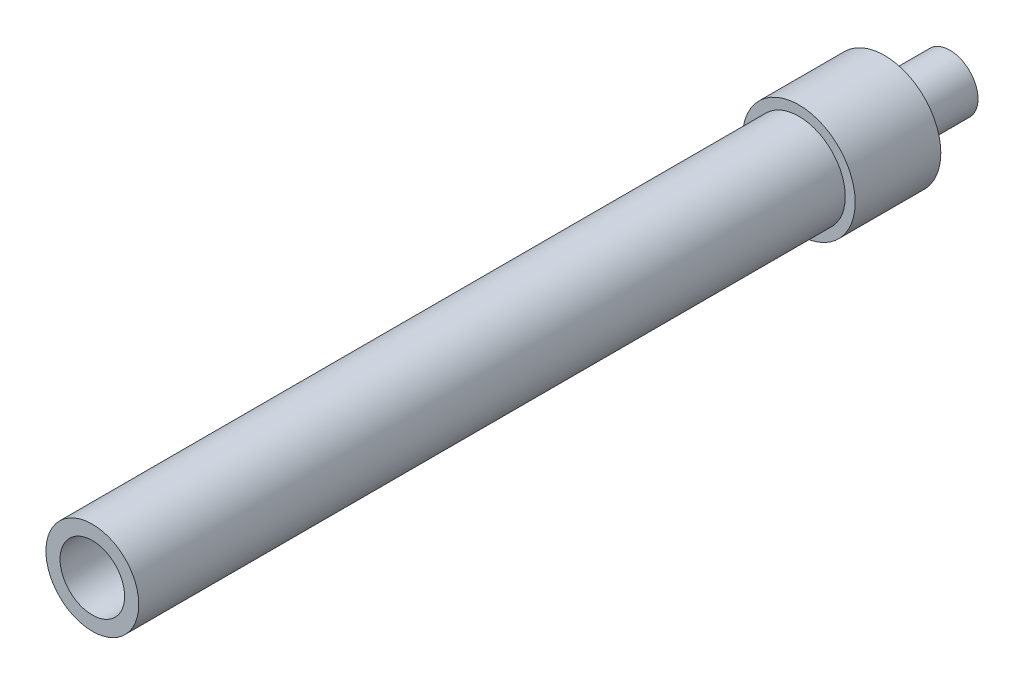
ISO-10303-21;
HEADER;
FILE_DESCRIPTION(('STEP AP214'),'2;1');
FILE_NAME('part.step','',(''),(''),'','','');
FILE_SCHEMA(('AUTOMOTIVE_DESIGN { 1 0 10303 214 1 1 1 1 }'));
ENDSEC;
DATA;
#1=APPLICATION_CONTEXT('core data for automotive mechanical design processes');
#2=APPLICATION_PROTOCOL_DEFINITION('international standard','automotive_design',2000,#1);
#3=PRODUCT_CONTEXT('',#1,'mechanical');
#4=PRODUCT('Part','Part','',(#3));
#5=PRODUCT_RELATED_PRODUCT_CATEGORY('part','',(#4));
#6=PRODUCT_DEFINITION_FORMATION('','',#4);
#7=PRODUCT_DEFINITION_CONTEXT('part definition',#1,'design');
#8=PRODUCT_DEFINITION('design','',#6,#7);
#9=PRODUCT_DEFINITION_SHAPE('','',#8);
#10=(LENGTH_UNIT() NAMED_UNIT(*) SI_UNIT(.MILLI.,.METRE.));
#11=(NAMED_UNIT(*) PLANE_ANGLE_UNIT() SI_UNIT($,.RADIAN.));
#12=(NAMED_UNIT(*) SI_UNIT($,.STERADIAN.) SOLID_ANGLE_UNIT());
#13=UNCERTAINTY_MEASURE_WITH_UNIT(LENGTH_MEASURE(1.E-05),#10,'distance_accuracy_value','');
#14=(GEOMETRIC_REPRESENTATION_CONTEXT(3) GLOBAL_UNCERTAINTY_ASSIGNED_CONTEXT((#13)) GLOBAL_UNIT_ASSIGNED_CONTEXT((#10,
#11,#12)) REPRESENTATION_CONTEXT('',''));
#15=CARTESIAN_POINT('',(0.,0.,0.));
#16=DIRECTION('',(0.,0.,1.));
#17=DIRECTION('',(1.,0.,0.));
#18=AXIS2_PLACEMENT_3D('',#15,#16,#17);
#19=CARTESIAN_POINT('',(0.,0.,0.));
#20=DIRECTION('',(0.,0.,1.));
#21=DIRECTION('',(1.,0.,0.));
#22=AXIS2_PLACEMENT_3D('',#19,#20,#21);
#23=PLANE('',#22);
#24=CARTESIAN_POINT('',(0.,0.,0.));
#25=DIRECTION('',(0.,0.,1.));
#26=DIRECTION('',(1.,0.,0.));
#27=AXIS2_PLACEMENT_3D('',#24,#25,#26);
#28=CIRCLE('',#27,6.35);
#29=CARTESIAN_POINT('',(6.35,0.,0.));
#30=VERTEX_POINT('',#29);
#31=EDGE_CURVE('E54',#30,#30,#28,.T.);
#32=ORIENTED_EDGE('',*,*,#31,.F.);
#33=EDGE_LOOP('',(#32));
#34=FACE_BOUND('',#33,.T.);
#35=CARTESIAN_POINT('',(0.,0.,0.));
#36=DIRECTION('',(0.,0.,1.));
#37=DIRECTION('',(1.,0.,0.));
#38=AXIS2_PLACEMENT_3D('',#35,#36,#37);
#39=CIRCLE('',#38,3.175);
#40=CARTESIAN_POINT('',(3.175,0.,0.));
#41=VERTEX_POINT('',#40);
#42=EDGE_CURVE('E10',#41,#41,#39,.F.);
#43=ORIENTED_EDGE('',*,*,#42,.F.);
#44=EDGE_LOOP('',(#43));
#45=FACE_BOUND('',#44,.T.);
#46=ADVANCED_FACE('F28',(#34,#45),#23,.F.);
#47=CARTESIAN_POINT('',(0.,0.,89.281));
#48=DIRECTION('',(0.,0.,1.));
#49=DIRECTION('',(1.,0.,0.));
#50=AXIS2_PLACEMENT_3D('',#47,#48,#49);
#51=PLANE('',#50);
#52=CARTESIAN_POINT('',(0.,0.,89.281));
#53=DIRECTION('',(0.,0.,1.));
#54=DIRECTION('',(1.,0.,0.));
#55=AXIS2_PLACEMENT_3D('',#52,#53,#54);
#56=CIRCLE('',#55,5.2324);
#57=CARTESIAN_POINT('',(5.2324,0.,89.281));
#58=VERTEX_POINT('',#57);
#59=EDGE_CURVE('E39',#58,#58,#56,.T.);
#60=ORIENTED_EDGE('',*,*,#59,.T.);
#61=EDGE_LOOP('',(#60));
#62=FACE_BOUND('',#61,.T.);
#63=CARTESIAN_POINT('',(0.,0.,89.281));
#64=DIRECTION('',(0.,0.,1.));
#65=DIRECTION('',(1.,0.,0.));
#66=AXIS2_PLACEMENT_3D('',#63,#64,#65);
#67=CIRCLE('',#66,3.63855);
#68=CARTESIAN_POINT('',(3.63855,0.,89.281));
#69=VERTEX_POINT('',#68);
#70=EDGE_CURVE('E43',#69,#69,#67,.T.);
#71=ORIENTED_EDGE('',*,*,#70,.F.);
#72=EDGE_LOOP('',(#71));
#73=FACE_BOUND('',#72,.T.);
#74=ADVANCED_FACE('F87',(#62,#73),#51,.T.);
#75=CARTESIAN_POINT('',(0.,0.,89.281));
#76=DIRECTION('',(0.,0.,-1.));
#77=DIRECTION('',(-1.,0.,0.));
#78=AXIS2_PLACEMENT_3D('',#75,#76,#77);
#79=CYLINDRICAL_SURFACE('',#78,5.2324);
#80=CARTESIAN_POINT('',(0.,0.,9.65199999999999));
#81=DIRECTION('',(0.,0.,1.));
#82=DIRECTION('',(1.,0.,0.));
#83=AXIS2_PLACEMENT_3D('',#80,#81,#82);
#84=CIRCLE('',#83,5.2324);
#85=CARTESIAN_POINT('',(5.2324,0.,9.65199999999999));
#86=VERTEX_POINT('',#85);
#87=EDGE_CURVE('E48',#86,#86,#84,.T.);
#88=ORIENTED_EDGE('',*,*,#87,.T.);
#89=EDGE_LOOP('',(#88));
#90=FACE_BOUND('',#89,.T.);
#91=ORIENTED_EDGE('',*,*,#59,.F.);
#92=EDGE_LOOP('',(#91));
#93=FACE_BOUND('',#92,.T.);
#94=ADVANCED_FACE('F30',(#90,#93),#79,.T.);
#95=CARTESIAN_POINT('',(0.,0.,89.281));
#96=DIRECTION('',(0.,0.,-1.));
#97=DIRECTION('',(-1.,0.,0.));
#98=AXIS2_PLACEMENT_3D('',#95,#96,#97);
#99=CYLINDRICAL_SURFACE('',#98,3.63855);
#100=CARTESIAN_POINT('',(0.,0.,9.65199999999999));
#101=DIRECTION('',(0.,0.,1.));
#102=DIRECTION('',(1.,0.,0.));
#103=AXIS2_PLACEMENT_3D('',#100,#101,#102);
#104=CIRCLE('',#103,3.63855);
#105=CARTESIAN_POINT('',(3.63855,0.,9.65199999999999));
#106=VERTEX_POINT('',#105);
#107=EDGE_CURVE('E35',#106,#106,#104,.T.);
#108=ORIENTED_EDGE('',*,*,#107,.F.);
#109=EDGE_LOOP('',(#108));
#110=FACE_BOUND('',#109,.T.);
#111=ORIENTED_EDGE('',*,*,#70,.T.);
#112=EDGE_LOOP('',(#111));
#113=FACE_BOUND('',#112,.T.);
#114=ADVANCED_FACE('F97',(#110,#113),#99,.F.);
#115=CARTESIAN_POINT('',(0.,0.,9.652));
#116=DIRECTION('',(0.,0.,1.));
#117=DIRECTION('',(1.,0.,0.));
#118=AXIS2_PLACEMENT_3D('',#115,#116,#117);
#119=PLANE('',#118);
#120=CARTESIAN_POINT('',(0.,0.,9.65199999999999));
#121=DIRECTION('',(0.,0.,1.));
#122=DIRECTION('',(1.,0.,0.));
#123=AXIS2_PLACEMENT_3D('',#120,#121,#122);
#124=CIRCLE('',#123,0.9652);
#125=CARTESIAN_POINT('',(0.9652,0.,9.65199999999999));
#126=VERTEX_POINT('',#125);
#127=EDGE_CURVE('E60',#126,#126,#124,.T.);
#128=ORIENTED_EDGE('',*,*,#127,.F.);
#129=EDGE_LOOP('',(#128));
#130=FACE_BOUND('',#129,.T.);
#131=ORIENTED_EDGE('',*,*,#107,.T.);
#132=EDGE_LOOP('',(#131));
#133=FACE_BOUND('',#132,.T.);
#134=ADVANCED_FACE('F99',(#130,#133),#119,.T.);
#135=CARTESIAN_POINT('',(0.,0.,9.652));
#136=DIRECTION('',(0.,0.,1.));
#137=DIRECTION('',(1.,0.,0.));
#138=AXIS2_PLACEMENT_3D('',#135,#136,#137);
#139=CIRCLE('',#138,6.35);
#140=CARTESIAN_POINT('',(6.35,0.,9.652));
#141=VERTEX_POINT('',#140);
#142=EDGE_CURVE('E51',#141,#141,#139,.T.);
#143=ORIENTED_EDGE('',*,*,#142,.T.);
#144=EDGE_LOOP('',(#143));
#145=FACE_BOUND('',#144,.T.);
#146=ORIENTED_EDGE('',*,*,#87,.F.);
#147=EDGE_LOOP('',(#146));
#148=FACE_BOUND('',#147,.T.);
#149=ADVANCED_FACE('F82',(#145,#148),#119,.T.);
#150=CARTESIAN_POINT('',(0.,0.,9.652));
#151=DIRECTION('',(0.,0.,-1.));
#152=DIRECTION('',(-1.,0.,0.));
#153=AXIS2_PLACEMENT_3D('',#150,#151,#152);
#154=CYLINDRICAL_SURFACE('',#153,6.35);
#155=ORIENTED_EDGE('',*,*,#142,.F.);
#156=EDGE_LOOP('',(#155));
#157=FACE_BOUND('',#156,.T.);
#158=ORIENTED_EDGE('',*,*,#31,.T.);
#159=EDGE_LOOP('',(#158));
#160=FACE_BOUND('',#159,.T.);
#161=ADVANCED_FACE('F77',(#157,#160),#154,.T.);
#162=CARTESIAN_POINT('',(0.,0.,-7.366));
#163=DIRECTION('',(0.,0.,1.));
#164=DIRECTION('',(1.,0.,0.));
#165=AXIS2_PLACEMENT_3D('',#162,#163,#164);
#166=CYLINDRICAL_SURFACE('',#165,3.175);
#167=CARTESIAN_POINT('',(0.,0.,-7.366));
#168=DIRECTION('',(0.,0.,-1.));
#169=DIRECTION('',(-1.,0.,0.));
#170=AXIS2_PLACEMENT_3D('',#167,#168,#169);
#171=CIRCLE('',#170,3.175);
#172=CARTESIAN_POINT('',(-3.175,0.,-7.366));
#173=VERTEX_POINT('',#172);
#174=EDGE_CURVE('E57',#173,#173,#171,.T.);
#175=ORIENTED_EDGE('',*,*,#174,.F.);
#176=EDGE_LOOP('',(#175));
#177=FACE_BOUND('',#176,.T.);
#178=ORIENTED_EDGE('',*,*,#42,.T.);
#179=EDGE_LOOP('',(#178));
#180=FACE_BOUND('',#179,.T.);
#181=ADVANCED_FACE('F72',(#177,#180),#166,.T.);
#182=CARTESIAN_POINT('',(0.,0.,-7.366));
#183=DIRECTION('',(0.,0.,-1.));
#184=DIRECTION('',(-1.,0.,0.));
#185=AXIS2_PLACEMENT_3D('',#182,#183,#184);
#186=PLANE('',#185);
#187=CARTESIAN_POINT('',(0.,0.,-7.366));
#188=DIRECTION('',(0.,0.,-1.));
#189=DIRECTION('',(-1.,0.,0.));
#190=AXIS2_PLACEMENT_3D('',#187,#188,#189);
#191=CIRCLE('',#190,0.9652);
#192=CARTESIAN_POINT('',(-0.9652,0.,-7.366));
#193=VERTEX_POINT('',#192);
#194=EDGE_CURVE('E63',#193,#193,#191,.T.);
#195=ORIENTED_EDGE('',*,*,#194,.F.);
#196=EDGE_LOOP('',(#195));
#197=FACE_BOUND('',#196,.T.);
#198=ORIENTED_EDGE('',*,*,#174,.T.);
#199=EDGE_LOOP('',(#198));
#200=FACE_BOUND('',#199,.T.);
#201=ADVANCED_FACE('F69',(#197,#200),#186,.T.);
#202=CARTESIAN_POINT('',(0.,0.,89.281));
#203=DIRECTION('',(0.,0.,-1.));
#204=DIRECTION('',(-1.,0.,0.));
#205=AXIS2_PLACEMENT_3D('',#202,#203,#204);
#206=CYLINDRICAL_SURFACE('',#205,0.9652);
#207=ORIENTED_EDGE('',*,*,#127,.T.);
#208=EDGE_LOOP('',(#207));
#209=FACE_BOUND('',#208,.T.);
#210=ORIENTED_EDGE('',*,*,#194,.T.);
#211=EDGE_LOOP('',(#210));
#212=FACE_BOUND('',#211,.T.);
#213=ADVANCED_FACE('F67',(#209,#212),#206,.F.);
#214=CLOSED_SHELL('',(#46,#74,#94,#114,#134,#149,#161,#181,#201,#213));
#215=MANIFOLD_SOLID_BREP('B2',#214);
#216=ADVANCED_BREP_SHAPE_REPRESENTATION('',(#18,#215),#14);
#217=SHAPE_DEFINITION_REPRESENTATION(#9,#216);
ENDSEC;
END-ISO-10303-21;
